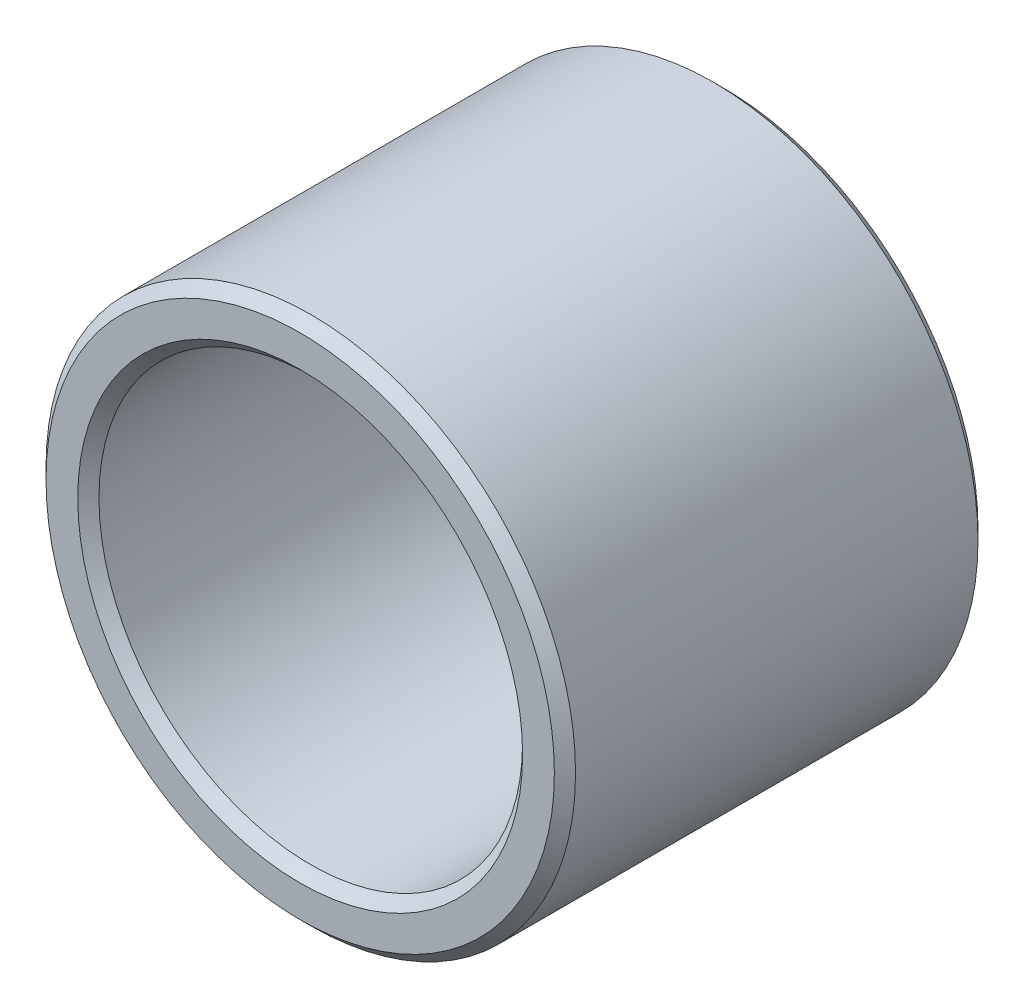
ISO-10303-21;
HEADER;
FILE_DESCRIPTION(('STEP AP214'),'2;1');
FILE_NAME('part.step','',(''),(''),'','','');
FILE_SCHEMA(('AUTOMOTIVE_DESIGN { 1 0 10303 214 1 1 1 1 }'));
ENDSEC;
DATA;
#1=APPLICATION_CONTEXT('core data for automotive mechanical design processes');
#2=APPLICATION_PROTOCOL_DEFINITION('international standard','automotive_design',2000,#1);
#3=PRODUCT_CONTEXT('',#1,'mechanical');
#4=PRODUCT('Part','Part','',(#3));
#5=PRODUCT_RELATED_PRODUCT_CATEGORY('part','',(#4));
#6=PRODUCT_DEFINITION_FORMATION('','',#4);
#7=PRODUCT_DEFINITION_CONTEXT('part definition',#1,'design');
#8=PRODUCT_DEFINITION('design','',#6,#7);
#9=PRODUCT_DEFINITION_SHAPE('','',#8);
#10=(LENGTH_UNIT() NAMED_UNIT(*) SI_UNIT(.MILLI.,.METRE.));
#11=(NAMED_UNIT(*) PLANE_ANGLE_UNIT() SI_UNIT($,.RADIAN.));
#12=(NAMED_UNIT(*) SI_UNIT($,.STERADIAN.) SOLID_ANGLE_UNIT());
#13=UNCERTAINTY_MEASURE_WITH_UNIT(LENGTH_MEASURE(1.E-05),#10,'distance_accuracy_value','');
#14=(GEOMETRIC_REPRESENTATION_CONTEXT(3) GLOBAL_UNCERTAINTY_ASSIGNED_CONTEXT((#13)) GLOBAL_UNIT_ASSIGNED_CONTEXT((#10,
#11,#12)) REPRESENTATION_CONTEXT('',''));
#15=CARTESIAN_POINT('',(0.,0.,0.));
#16=DIRECTION('',(0.,0.,1.));
#17=DIRECTION('',(1.,0.,0.));
#18=AXIS2_PLACEMENT_3D('',#15,#16,#17);
#19=CARTESIAN_POINT('',(0.,0.,40.));
#20=DIRECTION('',(0.,0.,1.));
#21=DIRECTION('',(1.,0.,0.));
#22=AXIS2_PLACEMENT_3D('',#19,#20,#21);
#23=PLANE('',#22);
#24=CARTESIAN_POINT('',(0.,0.,40.));
#25=DIRECTION('',(0.,0.,1.));
#26=DIRECTION('',(1.,0.,0.));
#27=AXIS2_PLACEMENT_3D('',#24,#25,#26);
#28=CIRCLE('',#27,24.);
#29=CARTESIAN_POINT('',(24.,0.,40.));
#30=VERTEX_POINT('',#29);
#31=EDGE_CURVE('E10',#30,#30,#28,.T.);
#32=ORIENTED_EDGE('',*,*,#31,.T.);
#33=EDGE_LOOP('',(#32));
#34=FACE_BOUND('',#33,.T.);
#35=CARTESIAN_POINT('',(0.,0.,40.));
#36=DIRECTION('',(0.,0.,1.));
#37=DIRECTION('',(1.,0.,0.));
#38=AXIS2_PLACEMENT_3D('',#35,#36,#37);
#39=CIRCLE('',#38,21.);
#40=CARTESIAN_POINT('',(21.,0.,40.));
#41=VERTEX_POINT('',#40);
#42=EDGE_CURVE('E31',#41,#41,#39,.F.);
#43=ORIENTED_EDGE('',*,*,#42,.T.);
#44=EDGE_LOOP('',(#43));
#45=FACE_BOUND('',#44,.T.);
#46=ADVANCED_FACE('F24',(#34,#45),#23,.T.);
#47=CARTESIAN_POINT('',(0.,0.,0.));
#48=DIRECTION('',(0.,0.,1.));
#49=DIRECTION('',(1.,0.,0.));
#50=AXIS2_PLACEMENT_3D('',#47,#48,#49);
#51=PLANE('',#50);
#52=CARTESIAN_POINT('',(0.,0.,0.));
#53=DIRECTION('',(0.,0.,1.));
#54=DIRECTION('',(1.,0.,0.));
#55=AXIS2_PLACEMENT_3D('',#52,#53,#54);
#56=CIRCLE('',#55,21.);
#57=CARTESIAN_POINT('',(21.,0.,0.));
#58=VERTEX_POINT('',#57);
#59=EDGE_CURVE('E50',#58,#58,#56,.T.);
#60=ORIENTED_EDGE('',*,*,#59,.T.);
#61=EDGE_LOOP('',(#60));
#62=FACE_BOUND('',#61,.T.);
#63=CARTESIAN_POINT('',(0.,0.,0.));
#64=DIRECTION('',(0.,0.,1.));
#65=DIRECTION('',(1.,0.,0.));
#66=AXIS2_PLACEMENT_3D('',#63,#64,#65);
#67=CIRCLE('',#66,24.);
#68=CARTESIAN_POINT('',(24.,0.,0.));
#69=VERTEX_POINT('',#68);
#70=EDGE_CURVE('E53',#69,#69,#67,.F.);
#71=ORIENTED_EDGE('',*,*,#70,.T.);
#72=EDGE_LOOP('',(#71));
#73=FACE_BOUND('',#72,.T.);
#74=ADVANCED_FACE('F57',(#62,#73),#51,.F.);
#75=CARTESIAN_POINT('',(0.,0.,40.));
#76=DIRECTION('',(0.,0.,-1.));
#77=DIRECTION('',(-1.,0.,0.));
#78=AXIS2_PLACEMENT_3D('',#75,#76,#77);
#79=CYLINDRICAL_SURFACE('',#78,25.);
#80=CARTESIAN_POINT('',(0.,0.,1.));
#81=DIRECTION('',(0.,0.,1.));
#82=DIRECTION('',(1.,0.,0.));
#83=AXIS2_PLACEMENT_3D('',#80,#81,#82);
#84=CIRCLE('',#83,25.);
#85=CARTESIAN_POINT('',(25.,0.,1.));
#86=VERTEX_POINT('',#85);
#87=EDGE_CURVE('E35',#86,#86,#84,.T.);
#88=ORIENTED_EDGE('',*,*,#87,.T.);
#89=EDGE_LOOP('',(#88));
#90=FACE_BOUND('',#89,.T.);
#91=CARTESIAN_POINT('',(0.,0.,39.));
#92=DIRECTION('',(0.,0.,1.));
#93=DIRECTION('',(1.,0.,0.));
#94=AXIS2_PLACEMENT_3D('',#91,#92,#93);
#95=CIRCLE('',#94,25.);
#96=CARTESIAN_POINT('',(25.,0.,39.));
#97=VERTEX_POINT('',#96);
#98=EDGE_CURVE('E39',#97,#97,#95,.F.);
#99=ORIENTED_EDGE('',*,*,#98,.T.);
#100=EDGE_LOOP('',(#99));
#101=FACE_BOUND('',#100,.T.);
#102=ADVANCED_FACE('F26',(#90,#101),#79,.T.);
#103=CARTESIAN_POINT('',(0.,0.,40.));
#104=DIRECTION('',(0.,0.,-1.));
#105=DIRECTION('',(-1.,0.,0.));
#106=AXIS2_PLACEMENT_3D('',#103,#104,#105);
#107=CYLINDRICAL_SURFACE('',#106,20.);
#108=CARTESIAN_POINT('',(0.,0.,1.));
#109=DIRECTION('',(0.,0.,1.));
#110=DIRECTION('',(1.,0.,0.));
#111=AXIS2_PLACEMENT_3D('',#108,#109,#110);
#112=CIRCLE('',#111,20.);
#113=CARTESIAN_POINT('',(20.,0.,1.));
#114=VERTEX_POINT('',#113);
#115=EDGE_CURVE('E44',#114,#114,#112,.F.);
#116=ORIENTED_EDGE('',*,*,#115,.T.);
#117=EDGE_LOOP('',(#116));
#118=FACE_BOUND('',#117,.T.);
#119=CARTESIAN_POINT('',(0.,0.,39.));
#120=DIRECTION('',(0.,0.,1.));
#121=DIRECTION('',(1.,0.,0.));
#122=AXIS2_PLACEMENT_3D('',#119,#120,#121);
#123=CIRCLE('',#122,20.);
#124=CARTESIAN_POINT('',(20.,0.,39.));
#125=VERTEX_POINT('',#124);
#126=EDGE_CURVE('E47',#125,#125,#123,.T.);
#127=ORIENTED_EDGE('',*,*,#126,.T.);
#128=EDGE_LOOP('',(#127));
#129=FACE_BOUND('',#128,.T.);
#130=ADVANCED_FACE('F69',(#118,#129),#107,.F.);
#131=CARTESIAN_POINT('',(0.,0.,0.));
#132=DIRECTION('',(0.,0.,-1.));
#133=DIRECTION('',(-1.,0.,0.));
#134=AXIS2_PLACEMENT_3D('',#131,#132,#133);
#135=CONICAL_SURFACE('',#134,21.,0.78539816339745);
#136=ORIENTED_EDGE('',*,*,#115,.F.);
#137=EDGE_LOOP('',(#136));
#138=FACE_BOUND('',#137,.T.);
#139=ORIENTED_EDGE('',*,*,#59,.F.);
#140=EDGE_LOOP('',(#139));
#141=FACE_BOUND('',#140,.T.);
#142=ADVANCED_FACE('F63',(#138,#141),#135,.F.);
#143=CARTESIAN_POINT('',(0.,0.,1.));
#144=DIRECTION('',(0.,0.,1.));
#145=DIRECTION('',(1.,0.,0.));
#146=AXIS2_PLACEMENT_3D('',#143,#144,#145);
#147=CONICAL_SURFACE('',#146,25.,0.785398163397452);
#148=ORIENTED_EDGE('',*,*,#70,.F.);
#149=EDGE_LOOP('',(#148));
#150=FACE_BOUND('',#149,.T.);
#151=ORIENTED_EDGE('',*,*,#87,.F.);
#152=EDGE_LOOP('',(#151));
#153=FACE_BOUND('',#152,.T.);
#154=ADVANCED_FACE('F59',(#150,#153),#147,.T.);
#155=CARTESIAN_POINT('',(0.,0.,40.));
#156=DIRECTION('',(0.,0.,-1.));
#157=DIRECTION('',(-1.,0.,0.));
#158=AXIS2_PLACEMENT_3D('',#155,#156,#157);
#159=CONICAL_SURFACE('',#158,24.,0.785398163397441);
#160=ORIENTED_EDGE('',*,*,#98,.F.);
#161=EDGE_LOOP('',(#160));
#162=FACE_BOUND('',#161,.T.);
#163=ORIENTED_EDGE('',*,*,#31,.F.);
#164=EDGE_LOOP('',(#163));
#165=FACE_BOUND('',#164,.T.);
#166=ADVANCED_FACE('F62',(#162,#165),#159,.T.);
#167=CARTESIAN_POINT('',(0.,0.,39.));
#168=DIRECTION('',(0.,0.,1.));
#169=DIRECTION('',(1.,0.,0.));
#170=AXIS2_PLACEMENT_3D('',#167,#168,#169);
#171=CONICAL_SURFACE('',#170,20.,0.785398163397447);
#172=ORIENTED_EDGE('',*,*,#42,.F.);
#173=EDGE_LOOP('',(#172));
#174=FACE_BOUND('',#173,.T.);
#175=ORIENTED_EDGE('',*,*,#126,.F.);
#176=EDGE_LOOP('',(#175));
#177=FACE_BOUND('',#176,.T.);
#178=ADVANCED_FACE('F74',(#174,#177),#171,.F.);
#179=CLOSED_SHELL('',(#46,#74,#102,#130,#142,#154,#166,#178));
#180=MANIFOLD_SOLID_BREP('B2',#179);
#181=ADVANCED_BREP_SHAPE_REPRESENTATION('',(#18,#180),#14);
#182=SHAPE_DEFINITION_REPRESENTATION(#9,#181);
ENDSEC;
END-ISO-10303-21;
